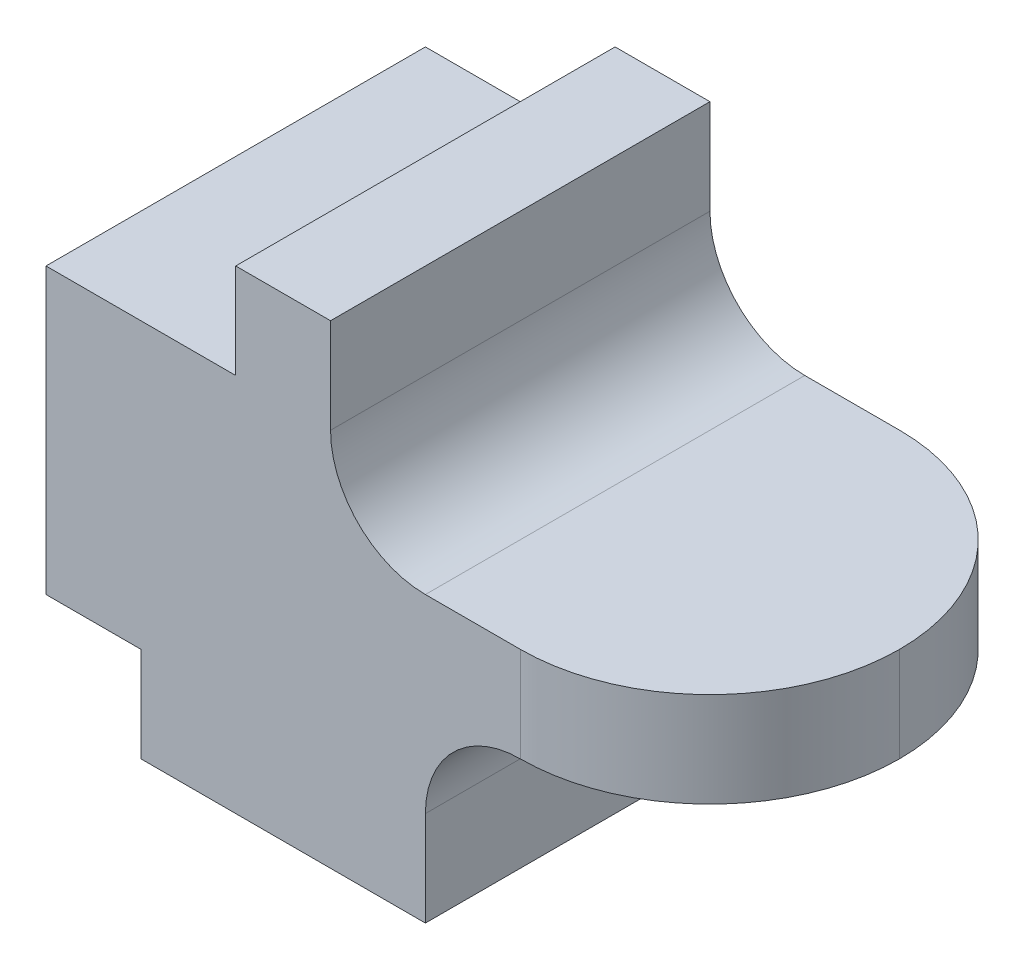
ISO-10303-21;
HEADER;
FILE_DESCRIPTION(('STEP AP214'),'2;1');
FILE_NAME('part.step','',(''),(''),'','','');
FILE_SCHEMA(('AUTOMOTIVE_DESIGN { 1 0 10303 214 1 1 1 1 }'));
ENDSEC;
DATA;
#1=APPLICATION_CONTEXT('core data for automotive mechanical design processes');
#2=APPLICATION_PROTOCOL_DEFINITION('international standard','automotive_design',2000,#1);
#3=PRODUCT_CONTEXT('',#1,'mechanical');
#4=PRODUCT('Part','Part','',(#3));
#5=PRODUCT_RELATED_PRODUCT_CATEGORY('part','',(#4));
#6=PRODUCT_DEFINITION_FORMATION('','',#4);
#7=PRODUCT_DEFINITION_CONTEXT('part definition',#1,'design');
#8=PRODUCT_DEFINITION('design','',#6,#7);
#9=PRODUCT_DEFINITION_SHAPE('','',#8);
#10=(LENGTH_UNIT() NAMED_UNIT(*) SI_UNIT(.MILLI.,.METRE.));
#11=(NAMED_UNIT(*) PLANE_ANGLE_UNIT() SI_UNIT($,.RADIAN.));
#12=(NAMED_UNIT(*) SI_UNIT($,.STERADIAN.) SOLID_ANGLE_UNIT());
#13=UNCERTAINTY_MEASURE_WITH_UNIT(LENGTH_MEASURE(1.E-05),#10,'distance_accuracy_value','');
#14=(GEOMETRIC_REPRESENTATION_CONTEXT(3) GLOBAL_UNCERTAINTY_ASSIGNED_CONTEXT((#13)) GLOBAL_UNIT_ASSIGNED_CONTEXT((#10,
#11,#12)) REPRESENTATION_CONTEXT('',''));
#15=CARTESIAN_POINT('',(0.,0.,0.));
#16=DIRECTION('',(0.,0.,1.));
#17=DIRECTION('',(1.,0.,0.));
#18=AXIS2_PLACEMENT_3D('',#15,#16,#17);
#19=CARTESIAN_POINT('',(30.,0.,20.));
#20=DIRECTION('',(0.,1.,0.));
#21=DIRECTION('',(-1.,0.,0.));
#22=AXIS2_PLACEMENT_3D('',#19,#20,#21);
#23=PLANE('',#22);
#24=DIRECTION('',(1.,0.,0.));
#25=VECTOR('',#24,1.);
#26=CARTESIAN_POINT('',(30.,0.,-20.));
#27=LINE('',#26,#25);
#28=CARTESIAN_POINT('',(0.,0.,-20.));
#29=VERTEX_POINT('',#28);
#30=CARTESIAN_POINT('',(30.,0.,-20.));
#31=VERTEX_POINT('',#30);
#32=EDGE_CURVE('E156',#29,#31,#27,.T.);
#33=ORIENTED_EDGE('',*,*,#32,.T.);
#34=DIRECTION('',(0.,0.,-1.));
#35=VECTOR('',#34,1.);
#36=CARTESIAN_POINT('',(30.,0.,20.));
#37=LINE('',#36,#35);
#38=CARTESIAN_POINT('',(30.,0.,20.));
#39=VERTEX_POINT('',#38);
#40=EDGE_CURVE('E136',#39,#31,#37,.T.);
#41=ORIENTED_EDGE('',*,*,#40,.F.);
#42=DIRECTION('',(1.,0.,0.));
#43=VECTOR('',#42,1.);
#44=CARTESIAN_POINT('',(30.,0.,20.));
#45=LINE('',#44,#43);
#46=CARTESIAN_POINT('',(0.,0.,20.));
#47=VERTEX_POINT('',#46);
#48=EDGE_CURVE('E144',#47,#39,#45,.T.);
#49=ORIENTED_EDGE('',*,*,#48,.F.);
#50=DIRECTION('',(0.,0.,-1.));
#51=VECTOR('',#50,1.);
#52=CARTESIAN_POINT('',(0.,0.,20.));
#53=LINE('',#52,#51);
#54=EDGE_CURVE('E227',#47,#29,#53,.T.);
#55=ORIENTED_EDGE('',*,*,#54,.T.);
#56=EDGE_LOOP('',(#33,#41,#49,#55));
#57=FACE_BOUND('',#56,.T.);
#58=ADVANCED_FACE('F30',(#57),#23,.F.);
#59=CARTESIAN_POINT('',(30.,20.,20.));
#60=DIRECTION('',(-1.,0.,0.));
#61=DIRECTION('',(0.,-1.,0.));
#62=AXIS2_PLACEMENT_3D('',#59,#60,#61);
#63=PLANE('',#62);
#64=DIRECTION('',(0.,1.,0.));
#65=VECTOR('',#64,1.);
#66=CARTESIAN_POINT('',(30.,20.,-20.));
#67=LINE('',#66,#65);
#68=CARTESIAN_POINT('',(30.,10.,-20.));
#69=VERTEX_POINT('',#68);
#70=EDGE_CURVE('E210',#31,#69,#67,.T.);
#71=ORIENTED_EDGE('',*,*,#70,.T.);
#72=DIRECTION('',(0.,0.,-1.));
#73=VECTOR('',#72,1.);
#74=CARTESIAN_POINT('',(30.,10.,20.));
#75=LINE('',#74,#73);
#76=CARTESIAN_POINT('',(30.,10.,20.));
#77=VERTEX_POINT('',#76);
#78=EDGE_CURVE('E139',#69,#77,#75,.F.);
#79=ORIENTED_EDGE('',*,*,#78,.T.);
#80=DIRECTION('',(0.,1.,0.));
#81=VECTOR('',#80,1.);
#82=CARTESIAN_POINT('',(30.,20.,20.));
#83=LINE('',#82,#81);
#84=EDGE_CURVE('E131',#39,#77,#83,.T.);
#85=ORIENTED_EDGE('',*,*,#84,.F.);
#86=ORIENTED_EDGE('',*,*,#40,.T.);
#87=EDGE_LOOP('',(#71,#79,#85,#86));
#88=FACE_BOUND('',#87,.T.);
#89=ADVANCED_FACE('F134',(#88),#63,.F.);
#90=CARTESIAN_POINT('',(60.,20.,20.));
#91=DIRECTION('',(0.,1.,0.));
#92=DIRECTION('',(-1.,0.,0.));
#93=AXIS2_PLACEMENT_3D('',#90,#91,#92);
#94=PLANE('',#93);
#95=DIRECTION('',(0.,0.,-1.));
#96=VECTOR('',#95,1.);
#97=CARTESIAN_POINT('',(40.,20.,-20.));
#98=LINE('',#97,#96);
#99=CARTESIAN_POINT('',(40.,20.,20.));
#100=VERTEX_POINT('',#99);
#101=CARTESIAN_POINT('',(40.,20.,-20.));
#102=VERTEX_POINT('',#101);
#103=EDGE_CURVE('E157',#100,#102,#98,.T.);
#104=ORIENTED_EDGE('',*,*,#103,.T.);
#105=CARTESIAN_POINT('',(40.,20.,0.));
#106=DIRECTION('',(0.,1.,0.));
#107=DIRECTION('',(-1.,0.,0.));
#108=AXIS2_PLACEMENT_3D('',#105,#106,#107);
#109=CIRCLE('',#108,20.);
#110=CARTESIAN_POINT('',(60.,20.,0.));
#111=VERTEX_POINT('',#110);
#112=EDGE_CURVE('E39',#102,#111,#109,.F.);
#113=ORIENTED_EDGE('',*,*,#112,.T.);
#114=CARTESIAN_POINT('',(40.,20.,0.));
#115=DIRECTION('',(0.,1.,0.));
#116=DIRECTION('',(-1.,0.,0.));
#117=AXIS2_PLACEMENT_3D('',#114,#115,#116);
#118=CIRCLE('',#117,20.);
#119=EDGE_CURVE('E188',#111,#100,#118,.F.);
#120=ORIENTED_EDGE('',*,*,#119,.T.);
#121=EDGE_LOOP('',(#104,#113,#120));
#122=FACE_BOUND('',#121,.T.);
#123=ADVANCED_FACE('F190',(#122),#94,.F.);
#124=CARTESIAN_POINT('',(20.,30.,20.));
#125=DIRECTION('',(0.,-1.,0.));
#126=DIRECTION('',(0.,0.,-1.));
#127=AXIS2_PLACEMENT_3D('',#124,#125,#126);
#128=PLANE('',#127);
#129=CARTESIAN_POINT('',(40.,30.,0.));
#130=DIRECTION('',(0.,-1.,0.));
#131=DIRECTION('',(0.,0.,-1.));
#132=AXIS2_PLACEMENT_3D('',#129,#130,#131);
#133=CIRCLE('',#132,20.);
#134=CARTESIAN_POINT('',(40.,30.,20.));
#135=VERTEX_POINT('',#134);
#136=CARTESIAN_POINT('',(60.,30.,0.));
#137=VERTEX_POINT('',#136);
#138=EDGE_CURVE('E53',#135,#137,#133,.F.);
#139=ORIENTED_EDGE('',*,*,#138,.T.);
#140=CARTESIAN_POINT('',(40.,30.,0.));
#141=DIRECTION('',(0.,-1.,0.));
#142=DIRECTION('',(0.,0.,-1.));
#143=AXIS2_PLACEMENT_3D('',#140,#141,#142);
#144=CIRCLE('',#143,20.);
#145=CARTESIAN_POINT('',(40.,30.,-20.));
#146=VERTEX_POINT('',#145);
#147=EDGE_CURVE('E183',#137,#146,#144,.F.);
#148=ORIENTED_EDGE('',*,*,#147,.T.);
#149=DIRECTION('',(-1.,0.,0.));
#150=VECTOR('',#149,1.);
#151=CARTESIAN_POINT('',(20.,30.,-20.));
#152=LINE('',#151,#150);
#153=CARTESIAN_POINT('',(30.,30.,-20.));
#154=VERTEX_POINT('',#153);
#155=EDGE_CURVE('E204',#146,#154,#152,.T.);
#156=ORIENTED_EDGE('',*,*,#155,.T.);
#157=DIRECTION('',(0.,0.,-1.));
#158=VECTOR('',#157,1.);
#159=CARTESIAN_POINT('',(30.,30.,20.));
#160=LINE('',#159,#158);
#161=CARTESIAN_POINT('',(30.,30.,20.));
#162=VERTEX_POINT('',#161);
#163=EDGE_CURVE('E170',#154,#162,#160,.F.);
#164=ORIENTED_EDGE('',*,*,#163,.T.);
#165=DIRECTION('',(-1.,0.,0.));
#166=VECTOR('',#165,1.);
#167=CARTESIAN_POINT('',(20.,30.,20.));
#168=LINE('',#167,#166);
#169=EDGE_CURVE('E143',#135,#162,#168,.T.);
#170=ORIENTED_EDGE('',*,*,#169,.F.);
#171=EDGE_LOOP('',(#139,#148,#156,#164,#170));
#172=FACE_BOUND('',#171,.T.);
#173=ADVANCED_FACE('F203',(#172),#128,.F.);
#174=CARTESIAN_POINT('',(20.,50.,20.));
#175=DIRECTION('',(-1.,0.,0.));
#176=DIRECTION('',(0.,-1.,0.));
#177=AXIS2_PLACEMENT_3D('',#174,#175,#176);
#178=PLANE('',#177);
#179=DIRECTION('',(0.,1.,0.));
#180=VECTOR('',#179,1.);
#181=CARTESIAN_POINT('',(20.,50.,20.));
#182=LINE('',#181,#180);
#183=CARTESIAN_POINT('',(20.,40.,20.));
#184=VERTEX_POINT('',#183);
#185=CARTESIAN_POINT('',(20.,50.,20.));
#186=VERTEX_POINT('',#185);
#187=EDGE_CURVE('E274',#184,#186,#182,.T.);
#188=ORIENTED_EDGE('',*,*,#187,.F.);
#189=DIRECTION('',(0.,0.,-1.));
#190=VECTOR('',#189,1.);
#191=CARTESIAN_POINT('',(20.,40.,-20.));
#192=LINE('',#191,#190);
#193=CARTESIAN_POINT('',(20.,40.,-20.));
#194=VERTEX_POINT('',#193);
#195=EDGE_CURVE('E167',#184,#194,#192,.T.);
#196=ORIENTED_EDGE('',*,*,#195,.T.);
#197=DIRECTION('',(0.,1.,0.));
#198=VECTOR('',#197,1.);
#199=CARTESIAN_POINT('',(20.,50.,-20.));
#200=LINE('',#199,#198);
#201=CARTESIAN_POINT('',(20.,50.,-20.));
#202=VERTEX_POINT('',#201);
#203=EDGE_CURVE('E209',#194,#202,#200,.T.);
#204=ORIENTED_EDGE('',*,*,#203,.T.);
#205=DIRECTION('',(0.,0.,-1.));
#206=VECTOR('',#205,1.);
#207=CARTESIAN_POINT('',(20.,50.,20.));
#208=LINE('',#207,#206);
#209=EDGE_CURVE('E158',#186,#202,#208,.T.);
#210=ORIENTED_EDGE('',*,*,#209,.F.);
#211=EDGE_LOOP('',(#188,#196,#204,#210));
#212=FACE_BOUND('',#211,.T.);
#213=ADVANCED_FACE('F282',(#212),#178,.F.);
#214=CARTESIAN_POINT('',(10.,50.,20.));
#215=DIRECTION('',(0.,-1.,0.));
#216=DIRECTION('',(0.,0.,-1.));
#217=AXIS2_PLACEMENT_3D('',#214,#215,#216);
#218=PLANE('',#217);
#219=DIRECTION('',(-1.,0.,0.));
#220=VECTOR('',#219,1.);
#221=CARTESIAN_POINT('',(10.,50.,-20.));
#222=LINE('',#221,#220);
#223=CARTESIAN_POINT('',(10.,50.,-20.));
#224=VERTEX_POINT('',#223);
#225=EDGE_CURVE('E212',#202,#224,#222,.T.);
#226=ORIENTED_EDGE('',*,*,#225,.T.);
#227=DIRECTION('',(0.,0.,-1.));
#228=VECTOR('',#227,1.);
#229=CARTESIAN_POINT('',(10.,50.,20.));
#230=LINE('',#229,#228);
#231=CARTESIAN_POINT('',(10.,50.,20.));
#232=VERTEX_POINT('',#231);
#233=EDGE_CURVE('E162',#232,#224,#230,.T.);
#234=ORIENTED_EDGE('',*,*,#233,.F.);
#235=DIRECTION('',(-1.,0.,0.));
#236=VECTOR('',#235,1.);
#237=CARTESIAN_POINT('',(10.,50.,20.));
#238=LINE('',#237,#236);
#239=EDGE_CURVE('E272',#186,#232,#238,.T.);
#240=ORIENTED_EDGE('',*,*,#239,.F.);
#241=ORIENTED_EDGE('',*,*,#209,.T.);
#242=EDGE_LOOP('',(#226,#234,#240,#241));
#243=FACE_BOUND('',#242,.T.);
#244=ADVANCED_FACE('F284',(#243),#218,.F.);
#245=CARTESIAN_POINT('',(10.,40.,20.));
#246=DIRECTION('',(1.,0.,0.));
#247=DIRECTION('',(0.,0.,-1.));
#248=AXIS2_PLACEMENT_3D('',#245,#246,#247);
#249=PLANE('',#248);
#250=DIRECTION('',(0.,-1.,0.));
#251=VECTOR('',#250,1.);
#252=CARTESIAN_POINT('',(10.,40.,-20.));
#253=LINE('',#252,#251);
#254=CARTESIAN_POINT('',(10.,40.,-20.));
#255=VERTEX_POINT('',#254);
#256=EDGE_CURVE('E218',#224,#255,#253,.T.);
#257=ORIENTED_EDGE('',*,*,#256,.T.);
#258=DIRECTION('',(0.,0.,-1.));
#259=VECTOR('',#258,1.);
#260=CARTESIAN_POINT('',(10.,40.,20.));
#261=LINE('',#260,#259);
#262=CARTESIAN_POINT('',(10.,40.,20.));
#263=VERTEX_POINT('',#262);
#264=EDGE_CURVE('E238',#263,#255,#261,.T.);
#265=ORIENTED_EDGE('',*,*,#264,.F.);
#266=DIRECTION('',(0.,-1.,0.));
#267=VECTOR('',#266,1.);
#268=CARTESIAN_POINT('',(10.,40.,20.));
#269=LINE('',#268,#267);
#270=EDGE_CURVE('E247',#232,#263,#269,.T.);
#271=ORIENTED_EDGE('',*,*,#270,.F.);
#272=ORIENTED_EDGE('',*,*,#233,.T.);
#273=EDGE_LOOP('',(#257,#265,#271,#272));
#274=FACE_BOUND('',#273,.T.);
#275=ADVANCED_FACE('F245',(#274),#249,.F.);
#276=CARTESIAN_POINT('',(-10.,40.,20.));
#277=DIRECTION('',(0.,-1.,0.));
#278=DIRECTION('',(0.,0.,-1.));
#279=AXIS2_PLACEMENT_3D('',#276,#277,#278);
#280=PLANE('',#279);
#281=DIRECTION('',(-1.,0.,0.));
#282=VECTOR('',#281,1.);
#283=CARTESIAN_POINT('',(-10.,40.,-20.));
#284=LINE('',#283,#282);
#285=CARTESIAN_POINT('',(-10.,40.,-20.));
#286=VERTEX_POINT('',#285);
#287=EDGE_CURVE('E220',#255,#286,#284,.T.);
#288=ORIENTED_EDGE('',*,*,#287,.T.);
#289=DIRECTION('',(0.,0.,-1.));
#290=VECTOR('',#289,1.);
#291=CARTESIAN_POINT('',(-10.,40.,20.));
#292=LINE('',#291,#290);
#293=CARTESIAN_POINT('',(-10.,40.,20.));
#294=VERTEX_POINT('',#293);
#295=EDGE_CURVE('E235',#294,#286,#292,.T.);
#296=ORIENTED_EDGE('',*,*,#295,.F.);
#297=DIRECTION('',(-1.,0.,0.));
#298=VECTOR('',#297,1.);
#299=CARTESIAN_POINT('',(-10.,40.,20.));
#300=LINE('',#299,#298);
#301=EDGE_CURVE('E265',#263,#294,#300,.T.);
#302=ORIENTED_EDGE('',*,*,#301,.F.);
#303=ORIENTED_EDGE('',*,*,#264,.T.);
#304=EDGE_LOOP('',(#288,#296,#302,#303));
#305=FACE_BOUND('',#304,.T.);
#306=ADVANCED_FACE('F256',(#305),#280,.F.);
#307=CARTESIAN_POINT('',(-10.,10.,20.));
#308=DIRECTION('',(1.,0.,0.));
#309=DIRECTION('',(0.,0.,-1.));
#310=AXIS2_PLACEMENT_3D('',#307,#308,#309);
#311=PLANE('',#310);
#312=DIRECTION('',(0.,-1.,0.));
#313=VECTOR('',#312,1.);
#314=CARTESIAN_POINT('',(-10.,10.,-20.));
#315=LINE('',#314,#313);
#316=CARTESIAN_POINT('',(-10.,10.,-20.));
#317=VERTEX_POINT('',#316);
#318=EDGE_CURVE('E222',#286,#317,#315,.T.);
#319=ORIENTED_EDGE('',*,*,#318,.T.);
#320=DIRECTION('',(0.,0.,-1.));
#321=VECTOR('',#320,1.);
#322=CARTESIAN_POINT('',(-10.,10.,20.));
#323=LINE('',#322,#321);
#324=CARTESIAN_POINT('',(-10.,10.,20.));
#325=VERTEX_POINT('',#324);
#326=EDGE_CURVE('E232',#325,#317,#323,.T.);
#327=ORIENTED_EDGE('',*,*,#326,.F.);
#328=DIRECTION('',(0.,-1.,0.));
#329=VECTOR('',#328,1.);
#330=CARTESIAN_POINT('',(-10.,10.,20.));
#331=LINE('',#330,#329);
#332=EDGE_CURVE('E262',#294,#325,#331,.T.);
#333=ORIENTED_EDGE('',*,*,#332,.F.);
#334=ORIENTED_EDGE('',*,*,#295,.T.);
#335=EDGE_LOOP('',(#319,#327,#333,#334));
#336=FACE_BOUND('',#335,.T.);
#337=ADVANCED_FACE('F260',(#336),#311,.F.);
#338=CARTESIAN_POINT('',(0.,10.,20.));
#339=DIRECTION('',(0.,1.,0.));
#340=DIRECTION('',(-1.,0.,0.));
#341=AXIS2_PLACEMENT_3D('',#338,#339,#340);
#342=PLANE('',#341);
#343=DIRECTION('',(1.,0.,0.));
#344=VECTOR('',#343,1.);
#345=CARTESIAN_POINT('',(0.,10.,-20.));
#346=LINE('',#345,#344);
#347=CARTESIAN_POINT('',(0.,10.,-20.));
#348=VERTEX_POINT('',#347);
#349=EDGE_CURVE('E224',#317,#348,#346,.T.);
#350=ORIENTED_EDGE('',*,*,#349,.T.);
#351=DIRECTION('',(0.,0.,-1.));
#352=VECTOR('',#351,1.);
#353=CARTESIAN_POINT('',(0.,10.,20.));
#354=LINE('',#353,#352);
#355=CARTESIAN_POINT('',(0.,10.,20.));
#356=VERTEX_POINT('',#355);
#357=EDGE_CURVE('E229',#356,#348,#354,.T.);
#358=ORIENTED_EDGE('',*,*,#357,.F.);
#359=DIRECTION('',(1.,0.,0.));
#360=VECTOR('',#359,1.);
#361=CARTESIAN_POINT('',(0.,10.,20.));
#362=LINE('',#361,#360);
#363=EDGE_CURVE('E264',#325,#356,#362,.T.);
#364=ORIENTED_EDGE('',*,*,#363,.F.);
#365=ORIENTED_EDGE('',*,*,#326,.T.);
#366=EDGE_LOOP('',(#350,#358,#364,#365));
#367=FACE_BOUND('',#366,.T.);
#368=ADVANCED_FACE('F340',(#367),#342,.F.);
#369=CARTESIAN_POINT('',(0.,0.,20.));
#370=DIRECTION('',(1.,0.,0.));
#371=DIRECTION('',(0.,0.,-1.));
#372=AXIS2_PLACEMENT_3D('',#369,#370,#371);
#373=PLANE('',#372);
#374=DIRECTION('',(0.,-1.,0.));
#375=VECTOR('',#374,1.);
#376=CARTESIAN_POINT('',(0.,0.,-20.));
#377=LINE('',#376,#375);
#378=EDGE_CURVE('E153',#348,#29,#377,.T.);
#379=ORIENTED_EDGE('',*,*,#378,.T.);
#380=ORIENTED_EDGE('',*,*,#54,.F.);
#381=DIRECTION('',(0.,-1.,0.));
#382=VECTOR('',#381,1.);
#383=CARTESIAN_POINT('',(0.,0.,20.));
#384=LINE('',#383,#382);
#385=EDGE_CURVE('E149',#356,#47,#384,.T.);
#386=ORIENTED_EDGE('',*,*,#385,.F.);
#387=ORIENTED_EDGE('',*,*,#357,.T.);
#388=EDGE_LOOP('',(#379,#380,#386,#387));
#389=FACE_BOUND('',#388,.T.);
#390=ADVANCED_FACE('F332',(#389),#373,.F.);
#391=CARTESIAN_POINT('',(0.,0.,20.));
#392=DIRECTION('',(0.,0.,-1.));
#393=DIRECTION('',(-1.,0.,0.));
#394=AXIS2_PLACEMENT_3D('',#391,#392,#393);
#395=PLANE('',#394);
#396=CARTESIAN_POINT('',(40.,10.,20.));
#397=DIRECTION('',(0.,0.,-1.));
#398=DIRECTION('',(-1.,0.,0.));
#399=AXIS2_PLACEMENT_3D('',#396,#397,#398);
#400=CIRCLE('',#399,10.);
#401=EDGE_CURVE('E175',#77,#100,#400,.T.);
#402=ORIENTED_EDGE('',*,*,#401,.T.);
#403=DIRECTION('',(0.,1.,0.));
#404=VECTOR('',#403,1.);
#405=CARTESIAN_POINT('',(40.,0.,20.));
#406=LINE('',#405,#404);
#407=EDGE_CURVE('E11',#100,#135,#406,.T.);
#408=ORIENTED_EDGE('',*,*,#407,.T.);
#409=ORIENTED_EDGE('',*,*,#169,.T.);
#410=CARTESIAN_POINT('',(30.,40.,20.));
#411=DIRECTION('',(0.,0.,-1.));
#412=DIRECTION('',(-1.,0.,0.));
#413=AXIS2_PLACEMENT_3D('',#410,#411,#412);
#414=CIRCLE('',#413,10.);
#415=EDGE_CURVE('E180',#162,#184,#414,.T.);
#416=ORIENTED_EDGE('',*,*,#415,.T.);
#417=ORIENTED_EDGE('',*,*,#187,.T.);
#418=ORIENTED_EDGE('',*,*,#239,.T.);
#419=ORIENTED_EDGE('',*,*,#270,.T.);
#420=ORIENTED_EDGE('',*,*,#301,.T.);
#421=ORIENTED_EDGE('',*,*,#332,.T.);
#422=ORIENTED_EDGE('',*,*,#363,.T.);
#423=ORIENTED_EDGE('',*,*,#385,.T.);
#424=ORIENTED_EDGE('',*,*,#48,.T.);
#425=ORIENTED_EDGE('',*,*,#84,.T.);
#426=EDGE_LOOP('',(#402,#408,#409,#416,#417,#418,#419,#420,#421,#422,#423,#424,#425));
#427=FACE_BOUND('',#426,.T.);
#428=ADVANCED_FACE('F147',(#427),#395,.F.);
#429=CARTESIAN_POINT('',(0.,0.,-20.));
#430=DIRECTION('',(0.,0.,-1.));
#431=DIRECTION('',(-1.,0.,0.));
#432=AXIS2_PLACEMENT_3D('',#429,#430,#431);
#433=PLANE('',#432);
#434=ORIENTED_EDGE('',*,*,#155,.F.);
#435=DIRECTION('',(0.,1.,0.));
#436=VECTOR('',#435,1.);
#437=CARTESIAN_POINT('',(40.,20.,-20.));
#438=LINE('',#437,#436);
#439=EDGE_CURVE('E185',#146,#102,#438,.F.);
#440=ORIENTED_EDGE('',*,*,#439,.T.);
#441=CARTESIAN_POINT('',(40.,10.,-20.));
#442=DIRECTION('',(0.,0.,-1.));
#443=DIRECTION('',(-1.,0.,0.));
#444=AXIS2_PLACEMENT_3D('',#441,#442,#443);
#445=CIRCLE('',#444,10.);
#446=EDGE_CURVE('E173',#102,#69,#445,.F.);
#447=ORIENTED_EDGE('',*,*,#446,.T.);
#448=ORIENTED_EDGE('',*,*,#70,.F.);
#449=ORIENTED_EDGE('',*,*,#32,.F.);
#450=ORIENTED_EDGE('',*,*,#378,.F.);
#451=ORIENTED_EDGE('',*,*,#349,.F.);
#452=ORIENTED_EDGE('',*,*,#318,.F.);
#453=ORIENTED_EDGE('',*,*,#287,.F.);
#454=ORIENTED_EDGE('',*,*,#256,.F.);
#455=ORIENTED_EDGE('',*,*,#225,.F.);
#456=ORIENTED_EDGE('',*,*,#203,.F.);
#457=CARTESIAN_POINT('',(30.,40.,-20.));
#458=DIRECTION('',(0.,0.,-1.));
#459=DIRECTION('',(-1.,0.,0.));
#460=AXIS2_PLACEMENT_3D('',#457,#458,#459);
#461=CIRCLE('',#460,10.);
#462=EDGE_CURVE('E177',#194,#154,#461,.F.);
#463=ORIENTED_EDGE('',*,*,#462,.T.);
#464=EDGE_LOOP('',(#434,#440,#447,#448,#449,#450,#451,#452,#453,#454,#455,#456,#463));
#465=FACE_BOUND('',#464,.T.);
#466=ADVANCED_FACE('F206',(#465),#433,.T.);
#467=CARTESIAN_POINT('',(40.,10.,20.));
#468=DIRECTION('',(0.,0.,1.));
#469=DIRECTION('',(1.,0.,0.));
#470=AXIS2_PLACEMENT_3D('',#467,#468,#469);
#471=CYLINDRICAL_SURFACE('',#470,10.);
#472=ORIENTED_EDGE('',*,*,#401,.F.);
#473=ORIENTED_EDGE('',*,*,#78,.F.);
#474=ORIENTED_EDGE('',*,*,#446,.F.);
#475=ORIENTED_EDGE('',*,*,#103,.F.);
#476=EDGE_LOOP('',(#472,#473,#474,#475));
#477=FACE_BOUND('',#476,.T.);
#478=ADVANCED_FACE('F197',(#477),#471,.F.);
#479=CARTESIAN_POINT('',(30.,40.,20.));
#480=DIRECTION('',(0.,0.,1.));
#481=DIRECTION('',(1.,0.,0.));
#482=AXIS2_PLACEMENT_3D('',#479,#480,#481);
#483=CYLINDRICAL_SURFACE('',#482,10.);
#484=ORIENTED_EDGE('',*,*,#415,.F.);
#485=ORIENTED_EDGE('',*,*,#163,.F.);
#486=ORIENTED_EDGE('',*,*,#462,.F.);
#487=ORIENTED_EDGE('',*,*,#195,.F.);
#488=EDGE_LOOP('',(#484,#485,#486,#487));
#489=FACE_BOUND('',#488,.T.);
#490=ADVANCED_FACE('F280',(#489),#483,.F.);
#491=CARTESIAN_POINT('',(40.,0.,0.));
#492=DIRECTION('',(0.,1.,0.));
#493=DIRECTION('',(-1.,0.,0.));
#494=AXIS2_PLACEMENT_3D('',#491,#492,#493);
#495=CYLINDRICAL_SURFACE('',#494,20.);
#496=ORIENTED_EDGE('',*,*,#407,.F.);
#497=ORIENTED_EDGE('',*,*,#119,.F.);
#498=DIRECTION('',(0.,1.,0.));
#499=VECTOR('',#498,1.);
#500=CARTESIAN_POINT('',(60.,30.,0.));
#501=LINE('',#500,#499);
#502=EDGE_CURVE('E34',#137,#111,#501,.F.);
#503=ORIENTED_EDGE('',*,*,#502,.F.);
#504=ORIENTED_EDGE('',*,*,#138,.F.);
#505=EDGE_LOOP('',(#496,#497,#503,#504));
#506=FACE_BOUND('',#505,.T.);
#507=ADVANCED_FACE('F32',(#506),#495,.T.);
#508=CARTESIAN_POINT('',(40.,30.,0.));
#509=DIRECTION('',(0.,-1.,0.));
#510=DIRECTION('',(1.,0.,0.));
#511=AXIS2_PLACEMENT_3D('',#508,#509,#510);
#512=CYLINDRICAL_SURFACE('',#511,20.);
#513=ORIENTED_EDGE('',*,*,#112,.F.);
#514=ORIENTED_EDGE('',*,*,#439,.F.);
#515=ORIENTED_EDGE('',*,*,#147,.F.);
#516=ORIENTED_EDGE('',*,*,#502,.T.);
#517=EDGE_LOOP('',(#513,#514,#515,#516));
#518=FACE_BOUND('',#517,.T.);
#519=ADVANCED_FACE('F201',(#518),#512,.T.);
#520=CLOSED_SHELL('',(#58,#89,#123,#173,#213,#244,#275,#306,#337,#368,#390,#428,#466,#478,#490,
#507,#519));
#521=MANIFOLD_SOLID_BREP('B2',#520);
#522=ADVANCED_BREP_SHAPE_REPRESENTATION('',(#18,#521),#14);
#523=SHAPE_DEFINITION_REPRESENTATION(#9,#522);
ENDSEC;
END-ISO-10303-21;
